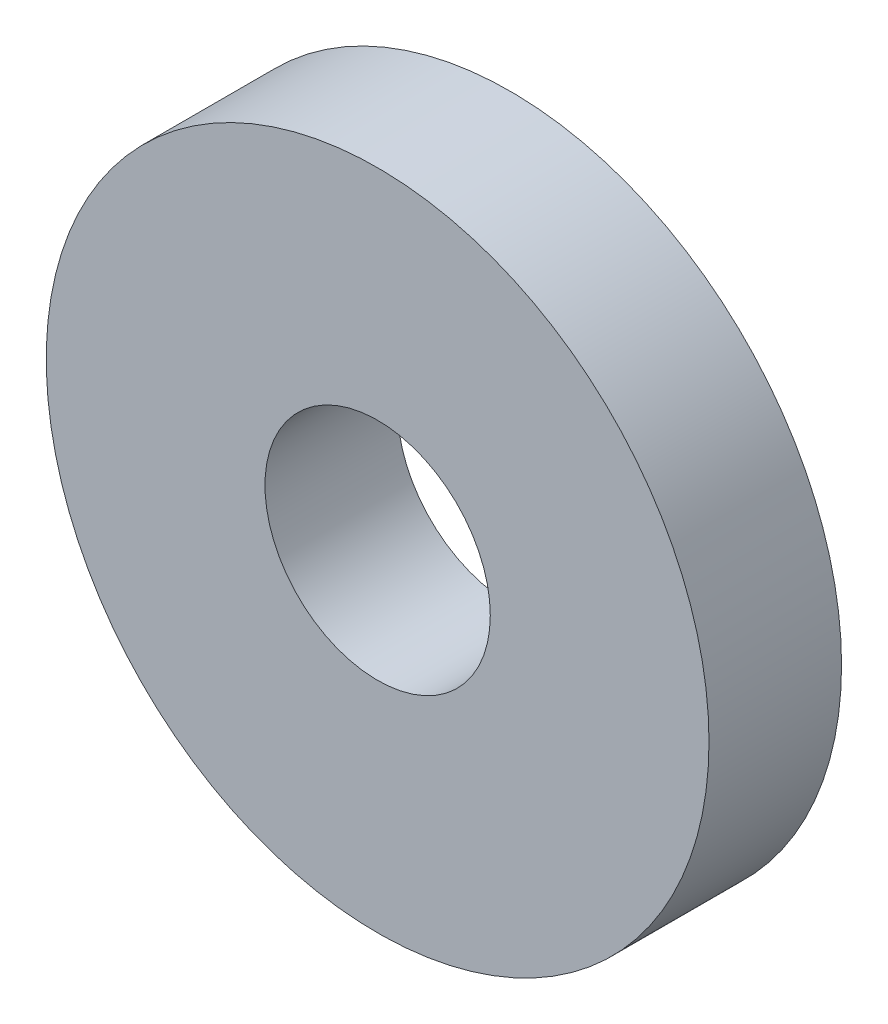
ISO-10303-21;
HEADER;
FILE_DESCRIPTION(('STEP AP214'),'2;1');
FILE_NAME('part.step','',(''),(''),'','','');
FILE_SCHEMA(('AUTOMOTIVE_DESIGN { 1 0 10303 214 1 1 1 1 }'));
ENDSEC;
DATA;
#1=APPLICATION_CONTEXT('core data for automotive mechanical design processes');
#2=APPLICATION_PROTOCOL_DEFINITION('international standard','automotive_design',2000,#1);
#3=PRODUCT_CONTEXT('',#1,'mechanical');
#4=PRODUCT('Part','Part','',(#3));
#5=PRODUCT_RELATED_PRODUCT_CATEGORY('part','',(#4));
#6=PRODUCT_DEFINITION_FORMATION('','',#4);
#7=PRODUCT_DEFINITION_CONTEXT('part definition',#1,'design');
#8=PRODUCT_DEFINITION('design','',#6,#7);
#9=PRODUCT_DEFINITION_SHAPE('','',#8);
#10=(LENGTH_UNIT() NAMED_UNIT(*) SI_UNIT(.MILLI.,.METRE.));
#11=(NAMED_UNIT(*) PLANE_ANGLE_UNIT() SI_UNIT($,.RADIAN.));
#12=(NAMED_UNIT(*) SI_UNIT($,.STERADIAN.) SOLID_ANGLE_UNIT());
#13=UNCERTAINTY_MEASURE_WITH_UNIT(LENGTH_MEASURE(1.E-05),#10,'distance_accuracy_value','');
#14=(GEOMETRIC_REPRESENTATION_CONTEXT(3) GLOBAL_UNCERTAINTY_ASSIGNED_CONTEXT((#13)) GLOBAL_UNIT_ASSIGNED_CONTEXT((#10,
#11,#12)) REPRESENTATION_CONTEXT('',''));
#15=CARTESIAN_POINT('',(0.,0.,0.));
#16=DIRECTION('',(0.,0.,1.));
#17=DIRECTION('',(1.,0.,0.));
#18=AXIS2_PLACEMENT_3D('',#15,#16,#17);
#19=CARTESIAN_POINT('',(0.,0.,5.));
#20=DIRECTION('',(0.,0.,-1.));
#21=DIRECTION('',(-1.,0.,0.));
#22=AXIS2_PLACEMENT_3D('',#19,#20,#21);
#23=PLANE('',#22);
#24=CARTESIAN_POINT('',(0.,0.,5.));
#25=DIRECTION('',(0.,0.,1.));
#26=DIRECTION('',(1.,0.,0.));
#27=AXIS2_PLACEMENT_3D('',#24,#25,#26);
#28=CIRCLE('',#27,4.25);
#29=CARTESIAN_POINT('',(4.25,0.,5.));
#30=VERTEX_POINT('',#29);
#31=EDGE_CURVE('E26',#30,#30,#28,.F.);
#32=ORIENTED_EDGE('',*,*,#31,.T.);
#33=EDGE_LOOP('',(#32));
#34=FACE_BOUND('',#33,.T.);
#35=CARTESIAN_POINT('',(0.,0.,5.));
#36=DIRECTION('',(0.,0.,1.));
#37=DIRECTION('',(1.,0.,0.));
#38=AXIS2_PLACEMENT_3D('',#35,#36,#37);
#39=CIRCLE('',#38,12.5);
#40=CARTESIAN_POINT('',(12.5,0.,5.));
#41=VERTEX_POINT('',#40);
#42=EDGE_CURVE('E17',#41,#41,#39,.F.);
#43=ORIENTED_EDGE('',*,*,#42,.F.);
#44=EDGE_LOOP('',(#43));
#45=FACE_BOUND('',#44,.T.);
#46=ADVANCED_FACE('F14',(#34,#45),#23,.F.);
#47=CARTESIAN_POINT('',(0.,0.,0.));
#48=DIRECTION('',(0.,0.,1.));
#49=DIRECTION('',(1.,0.,0.));
#50=AXIS2_PLACEMENT_3D('',#47,#48,#49);
#51=CYLINDRICAL_SURFACE('',#50,12.5);
#52=CARTESIAN_POINT('',(0.,0.,0.));
#53=DIRECTION('',(0.,0.,1.));
#54=DIRECTION('',(1.,0.,0.));
#55=AXIS2_PLACEMENT_3D('',#52,#53,#54);
#56=CIRCLE('',#55,12.5);
#57=CARTESIAN_POINT('',(12.5,0.,0.));
#58=VERTEX_POINT('',#57);
#59=EDGE_CURVE('E21',#58,#58,#56,.F.);
#60=ORIENTED_EDGE('',*,*,#59,.F.);
#61=EDGE_LOOP('',(#60));
#62=FACE_BOUND('',#61,.T.);
#63=ORIENTED_EDGE('',*,*,#42,.T.);
#64=EDGE_LOOP('',(#63));
#65=FACE_BOUND('',#64,.T.);
#66=ADVANCED_FACE('F34',(#62,#65),#51,.T.);
#67=CARTESIAN_POINT('',(0.,0.,0.));
#68=DIRECTION('',(0.,0.,1.));
#69=DIRECTION('',(1.,0.,0.));
#70=AXIS2_PLACEMENT_3D('',#67,#68,#69);
#71=CYLINDRICAL_SURFACE('',#70,4.25);
#72=CARTESIAN_POINT('',(0.,0.,0.));
#73=DIRECTION('',(0.,0.,1.));
#74=DIRECTION('',(1.,0.,0.));
#75=AXIS2_PLACEMENT_3D('',#72,#73,#74);
#76=CIRCLE('',#75,4.25);
#77=CARTESIAN_POINT('',(4.25,0.,0.));
#78=VERTEX_POINT('',#77);
#79=EDGE_CURVE('E10',#78,#78,#76,.T.);
#80=ORIENTED_EDGE('',*,*,#79,.F.);
#81=EDGE_LOOP('',(#80));
#82=FACE_BOUND('',#81,.T.);
#83=ORIENTED_EDGE('',*,*,#31,.F.);
#84=EDGE_LOOP('',(#83));
#85=FACE_BOUND('',#84,.T.);
#86=ADVANCED_FACE('F41',(#82,#85),#71,.F.);
#87=CARTESIAN_POINT('',(0.,0.,0.));
#88=DIRECTION('',(0.,0.,-1.));
#89=DIRECTION('',(-1.,0.,0.));
#90=AXIS2_PLACEMENT_3D('',#87,#88,#89);
#91=PLANE('',#90);
#92=ORIENTED_EDGE('',*,*,#79,.T.);
#93=EDGE_LOOP('',(#92));
#94=FACE_BOUND('',#93,.T.);
#95=ORIENTED_EDGE('',*,*,#59,.T.);
#96=EDGE_LOOP('',(#95));
#97=FACE_BOUND('',#96,.T.);
#98=ADVANCED_FACE('F43',(#94,#97),#91,.T.);
#99=CLOSED_SHELL('',(#46,#66,#86,#98));
#100=MANIFOLD_SOLID_BREP('B1',#99);
#101=ADVANCED_BREP_SHAPE_REPRESENTATION('',(#18,#100),#14);
#102=SHAPE_DEFINITION_REPRESENTATION(#9,#101);
ENDSEC;
END-ISO-10303-21;
